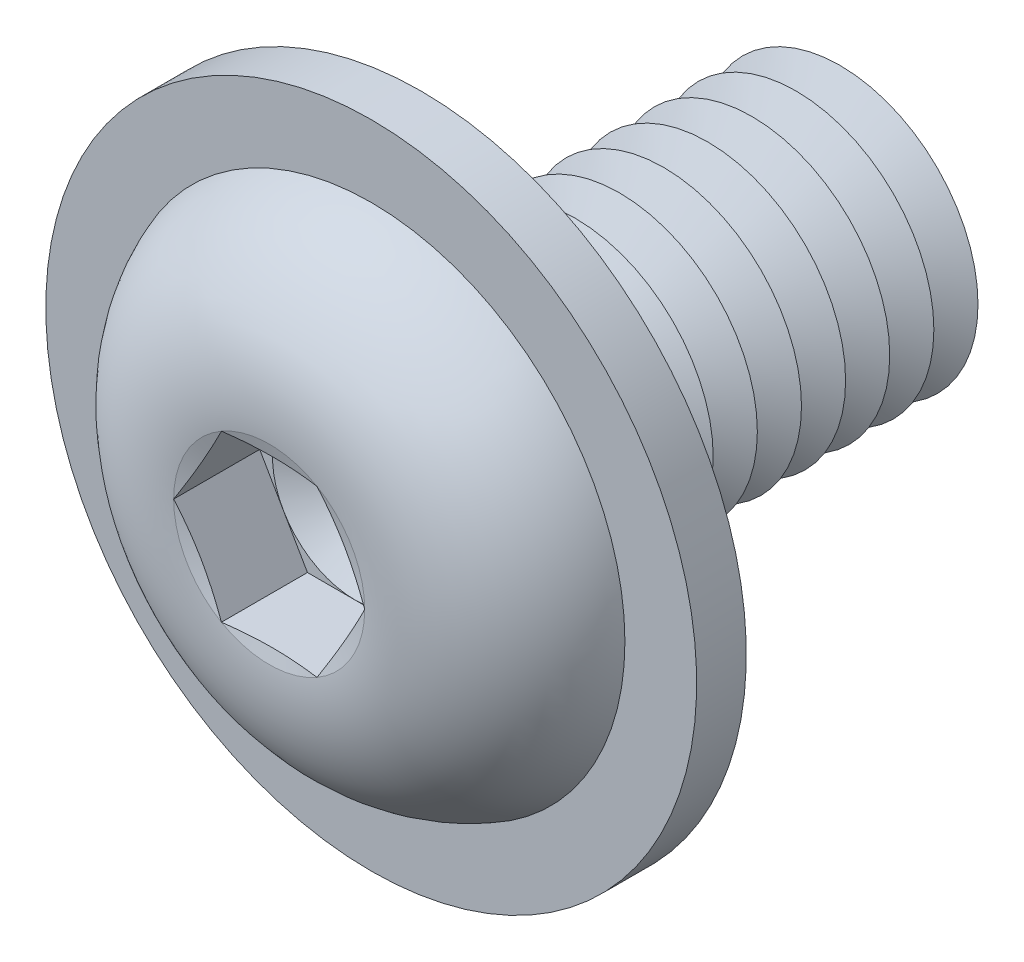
from build123d import *

# Parameters (mm, degrees)
FILLET1_R           = 0.4
LPATTERN1_COUNT     = 10
LPATTERN1_PITCH     = 0.8
CUT_EXTRUDE1_DEPTH  = 1.56
SKETCH5_R           = 5.9
SKETCH5_R_2         = 2.9
BOSS_EXTRUDE1_DEPTH = 0.9


with BuildPart() as part:
    # Sketch1 → Revolve1 (revolve)
    with BuildSketch(Plane(origin=(0, 0, 0), x_dir=(0, 0, -1), z_dir=(1, 0, 0)), mode=Mode.PRIVATE) as revolve1_sk:
        with BuildLine():
            Line((0, 2.5), (0, 4.75))
            ThreePointArc((0, 4.75), (-2.041477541, 3.848329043), (-2.75, 1.73205))
            Line((-2.75, 1.73205), (-2.517949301, 0.866025))
            Line((-2.517949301, 0.866025), (-2.75, 0.866025))
            Line((-2.75, 0.866025), (-2.75, 0))
            Line((-2.75, 0), (8, 0))
            Line((8, 0), (8, 2.5))
            Line((8, 2.5), (0, 2.5))
        make_face()
    revolve(revolve1_sk.sketch.rotate(Axis((0, 0, -8), (0, 0, 1)), 90), axis=Axis((0, 0, -8), (0, 0, 1)))

    # Fillet1
    fillet1_edges = [part.edges().sort_by_distance(p)[0] for p in [
        (2.5, 0, 0),
    ]]
    fillet(fillet1_edges, radius=FILLET1_R)

    # Sketch2 → Cut-Revolve1 (revolve, cut)
    with BuildSketch(Plane(origin=(0, 0, 0), x_dir=(0, 0, -1), z_dir=(1, 0, 0)), mode=Mode.PRIVATE) as cut_revolve1_sk:
        Polygon((7.6, 2.5), (8.4, 2.5), (8, 1.807179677), align=None)
    cut_revolve1 = revolve(cut_revolve1_sk.sketch.rotate(Axis((0, 0, -8), (0, 0, -1)), 270), axis=Axis((0, 0, -8), (0, 0, -1)), mode=Mode.SUBTRACT)

    # LPattern1: Cut-Revolve1 ×10
    with Locations(*[(0, 0, i * LPATTERN1_PITCH) for i in range(1, LPATTERN1_COUNT)]):
        add(cut_revolve1, mode=Mode.SUBTRACT)

    # Sketch3 → Cut-Extrude1 (cut)
    with BuildSketch(Plane.XY.offset(2.75)):
        Polygon((0.866025, 1.499999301), (-0.866025, 1.499999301), (-1.73205, 0), (-0.866025, -1.499999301), (0.866025, -1.499999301), (1.73205, 0), align=None)
    extrude(amount=-CUT_EXTRUDE1_DEPTH, mode=Mode.SUBTRACT)

    # Cut-Extrude2 cone 1 section (on through the dimple's axis) → Cut-Extrude2 (revolve, cut)
    with BuildSketch(Plane(origin=(0, 0, 1.19), x_dir=(0, -1, 0), z_dir=(1, 0, 0))):
        Polygon((0, 0), (1.499999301, 0), (0, 0.866025), align=None)
    revolve(axis=Axis((0, 0, 1.19), (0, 0, -1)), mode=Mode.SUBTRACT)

    # Sketch5 → Boss-Extrude1 (add)
    with BuildSketch(Plane(origin=(0, 0, 0), x_dir=(-1, 0, 0), z_dir=(0, 0, -1))):
        with Locations(Location((0, 0, 0), (0, 0, 90))):
            Circle(SKETCH5_R)
        Circle(SKETCH5_R_2, mode=Mode.SUBTRACT)
    extrude(amount=-BOSS_EXTRUDE1_DEPTH)


solid = part.part
